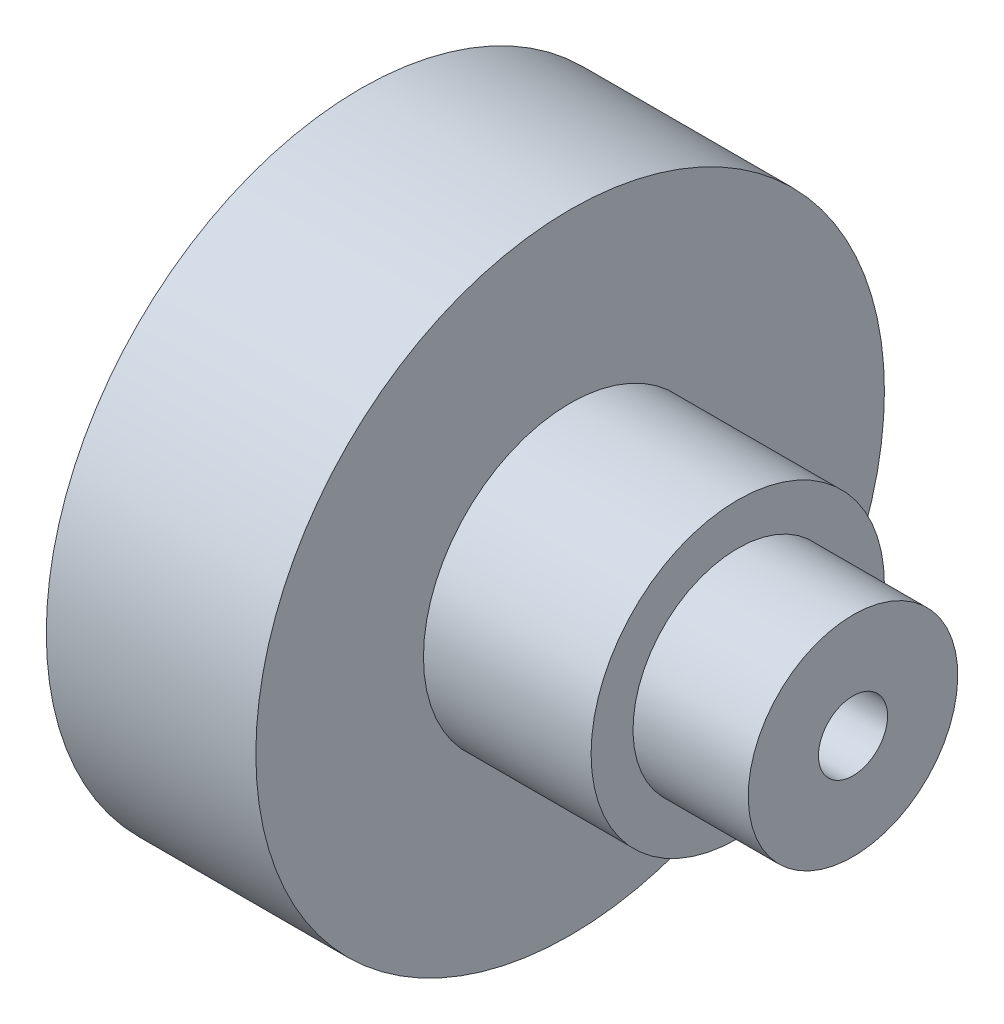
from build123d import *

# Parameters (mm, degrees)
M4_TAPPED_HOLE1_D     = 3.3
M4_TAPPED_HOLE1_DEPTH = 22.5
M4_TAPPED_HOLE1_TIP   = 0.991420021
SKETCH7_R             = 1.65
EXTRUDE1_DEPTH        = 5


with BuildPart() as part:
    # Sketch1 → Revolve1 (revolve)
    with BuildSketch(Plane.XY):
        Polygon((0, 0), (0, 15), (10, 15), (10, 7), (18, 7), (18, 5), (23.5, 5), (23.5, 0), align=None)
    revolve(axis=Axis((23.5, 0, 0), (-1, 0, 0)))

    # M4 Tapped Hole1
    with Locations(Plane.YZ.offset(23.5)):
        with Locations((0, 0)):
            Hole(M4_TAPPED_HOLE1_D / 2, depth=M4_TAPPED_HOLE1_DEPTH)
            with Locations((0, 0, -(M4_TAPPED_HOLE1_DEPTH + M4_TAPPED_HOLE1_TIP / 2))):  # 118° drill point
                Cone(0, M4_TAPPED_HOLE1_D / 2, M4_TAPPED_HOLE1_TIP, mode=Mode.SUBTRACT)

    # Sketch7 → Extrude1 (cut)
    with BuildSketch(Plane.ZY):
        with Locations(Location((0, 0, 0), (0, 0, 180))):
            Circle(SKETCH7_R)
    extrude(amount=-EXTRUDE1_DEPTH, mode=Mode.SUBTRACT)


solid = part.part
